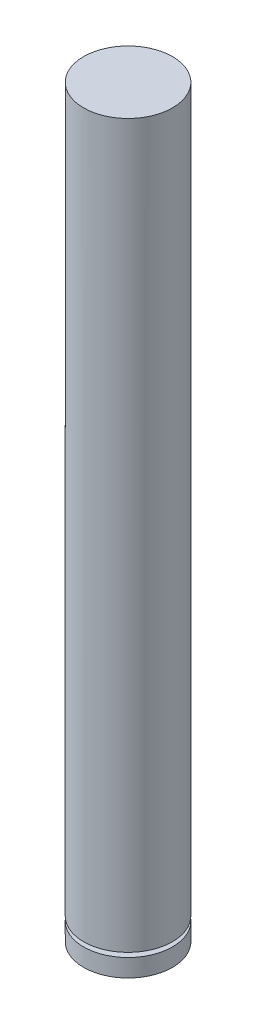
from build123d import *

# Parameters (mm, degrees)
SKETCH1_R           = 2
BOSS_EXTRUDE1_DEPTH = 33.5
SKETCH2_W           = 0.5
SKETCH2_H           = 0.2


with BuildPart() as part:
    # Sketch1 → Boss-Extrude1 (new body)
    with BuildSketch(Plane(origin=(0, 0, 0), x_dir=(1, 0, 0), z_dir=(0, 1, 0))):
        with Locations(Location((0, 0, 0), (0, 0, 270))):
            Circle(SKETCH1_R)
    extrude(amount=BOSS_EXTRUDE1_DEPTH)

    # Sketch2 → Cut-Revolve1 (revolve, cut)
    with BuildSketch(Plane.XY, mode=Mode.PRIVATE) as cut_revolve1_sk:
        with Locations((1.75, 0.9)):
            Rectangle(SKETCH2_W, SKETCH2_H)
    revolve(cut_revolve1_sk.sketch.rotate(Axis((0, -1.7, 0), (0, 1, 0)), 90), axis=Axis((0, -1.7, 0), (0, 1, 0)), mode=Mode.SUBTRACT)


solid = part.part
